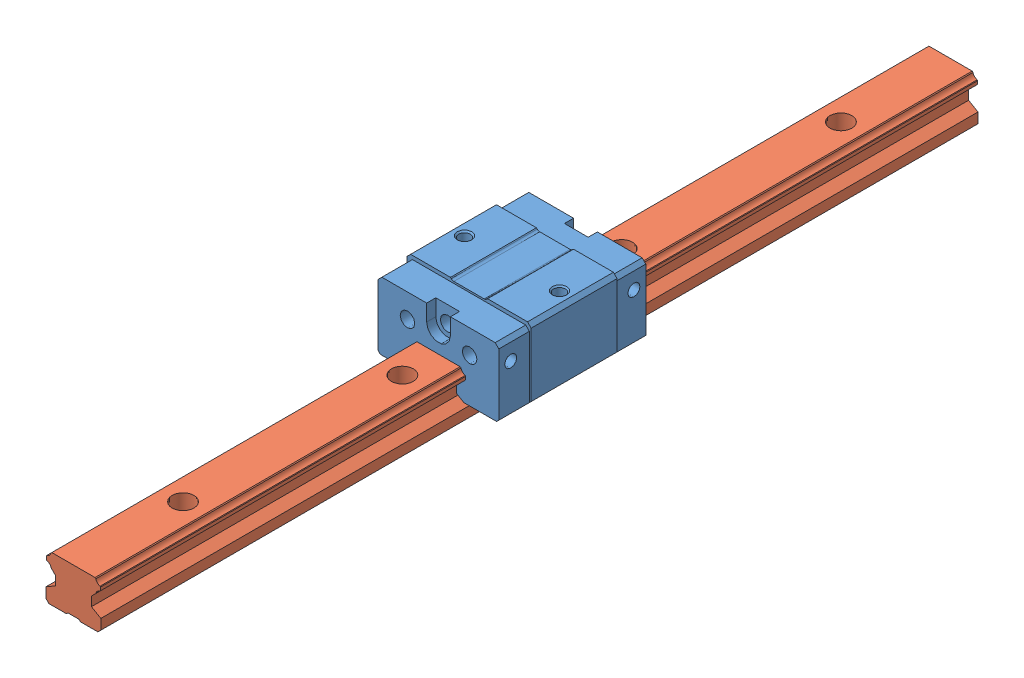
SolidWorks assembly IAP01-H24-L240.sldasm, configuration Default (file format 13000). Lengths in mm.
Overall size (34 24 240).
2 component instances, 2 part files, 0 mates.
Components (placement in the parent):
- ELH15SA-1: ELH15SA.SLDPRT [Default] at (0 24 -99.9) size (34 19.5 40.2)
- ELR15R240 E=30-1: ELR15R240 E=30.SLDPRT [Default] at (0 24 0) size (15 12.5 240)
